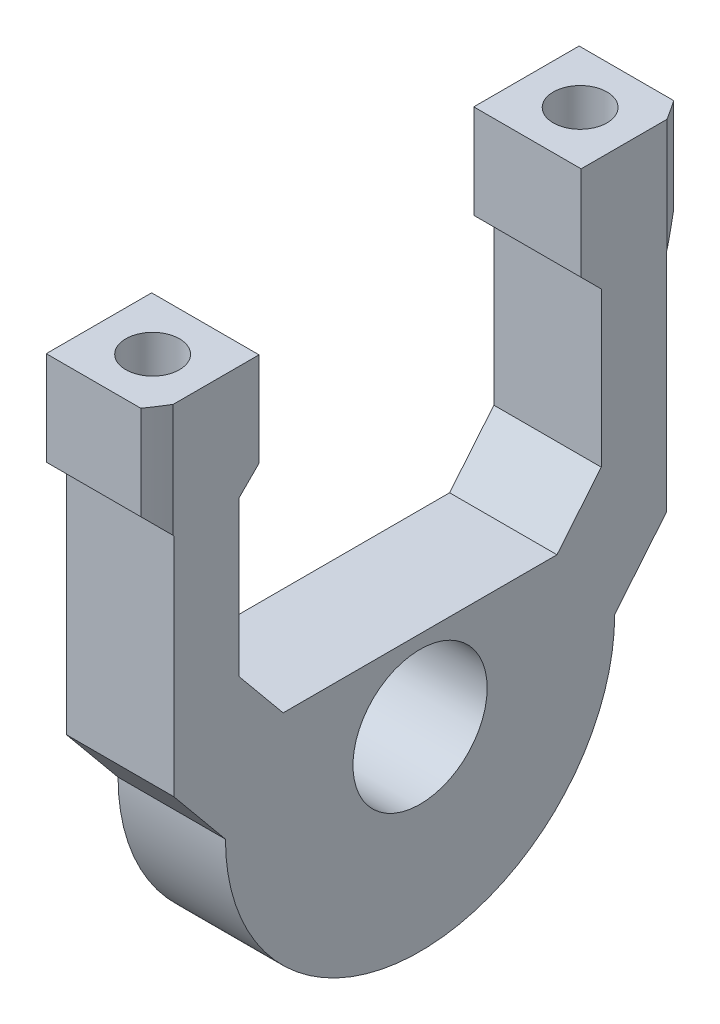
ISO-10303-21;
HEADER;
FILE_DESCRIPTION(('STEP AP214'),'2;1');
FILE_NAME('part.step','',(''),(''),'','','');
FILE_SCHEMA(('AUTOMOTIVE_DESIGN { 1 0 10303 214 1 1 1 1 }'));
ENDSEC;
DATA;
#1=APPLICATION_CONTEXT('core data for automotive mechanical design processes');
#2=APPLICATION_PROTOCOL_DEFINITION('international standard','automotive_design',2000,#1);
#3=PRODUCT_CONTEXT('',#1,'mechanical');
#4=PRODUCT('Part','Part','',(#3));
#5=PRODUCT_RELATED_PRODUCT_CATEGORY('part','',(#4));
#6=PRODUCT_DEFINITION_FORMATION('','',#4);
#7=PRODUCT_DEFINITION_CONTEXT('part definition',#1,'design');
#8=PRODUCT_DEFINITION('design','',#6,#7);
#9=PRODUCT_DEFINITION_SHAPE('','',#8);
#10=(LENGTH_UNIT() NAMED_UNIT(*) SI_UNIT(.MILLI.,.METRE.));
#11=(NAMED_UNIT(*) PLANE_ANGLE_UNIT() SI_UNIT($,.RADIAN.));
#12=(NAMED_UNIT(*) SI_UNIT($,.STERADIAN.) SOLID_ANGLE_UNIT());
#13=UNCERTAINTY_MEASURE_WITH_UNIT(LENGTH_MEASURE(1.E-05),#10,'distance_accuracy_value','');
#14=(GEOMETRIC_REPRESENTATION_CONTEXT(3) GLOBAL_UNCERTAINTY_ASSIGNED_CONTEXT((#13)) GLOBAL_UNIT_ASSIGNED_CONTEXT((#10,
#11,#12)) REPRESENTATION_CONTEXT('',''));
#15=CARTESIAN_POINT('',(0.,0.,0.));
#16=DIRECTION('',(0.,0.,1.));
#17=DIRECTION('',(1.,0.,0.));
#18=AXIS2_PLACEMENT_3D('',#15,#16,#17);
#19=CARTESIAN_POINT('',(-8.445,0.,18.35));
#20=DIRECTION('',(0.,0.,-1.));
#21=DIRECTION('',(-1.,0.,0.));
#22=AXIS2_PLACEMENT_3D('',#19,#20,#21);
#23=PLANE('',#22);
#24=DIRECTION('',(0.,1.,0.));
#25=VECTOR('',#24,1.);
#26=CARTESIAN_POINT('',(-0.445,0.,18.35));
#27=LINE('',#26,#25);
#28=CARTESIAN_POINT('',(-0.445,4.66666666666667,18.35));
#29=VERTEX_POINT('',#28);
#30=CARTESIAN_POINT('',(-0.445,21.5,18.35));
#31=VERTEX_POINT('',#30);
#32=EDGE_CURVE('E400',#29,#31,#27,.T.);
#33=ORIENTED_EDGE('',*,*,#32,.T.);
#34=DIRECTION('',(1.,0.,0.));
#35=VECTOR('',#34,1.);
#36=CARTESIAN_POINT('',(-18.0626920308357,21.5,18.35));
#37=LINE('',#36,#35);
#38=CARTESIAN_POINT('',(-8.445,21.5,18.35));
#39=VERTEX_POINT('',#38);
#40=EDGE_CURVE('E333',#39,#31,#37,.T.);
#41=ORIENTED_EDGE('',*,*,#40,.F.);
#42=DIRECTION('',(0.,1.,0.));
#43=VECTOR('',#42,1.);
#44=CARTESIAN_POINT('',(-8.445,0.,18.35));
#45=LINE('',#44,#43);
#46=CARTESIAN_POINT('',(-8.445,4.66666666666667,18.35));
#47=VERTEX_POINT('',#46);
#48=EDGE_CURVE('E362',#47,#39,#45,.T.);
#49=ORIENTED_EDGE('',*,*,#48,.F.);
#50=DIRECTION('',(1.,0.,0.));
#51=VECTOR('',#50,1.);
#52=CARTESIAN_POINT('',(-8.445,4.66666666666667,18.35));
#53=LINE('',#52,#51);
#54=EDGE_CURVE('E438',#47,#29,#53,.T.);
#55=ORIENTED_EDGE('',*,*,#54,.T.);
#56=EDGE_LOOP('',(#33,#41,#49,#55));
#57=FACE_BOUND('',#56,.T.);
#58=ADVANCED_FACE('F56',(#57),#23,.F.);
#59=CARTESIAN_POINT('',(-8.445,-7.1178876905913,8.62774265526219));
#60=DIRECTION('',(0.,-0.636382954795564,0.771373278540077));
#61=DIRECTION('',(0.,-0.771373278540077,-0.636382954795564));
#62=AXIS2_PLACEMENT_3D('',#59,#60,#61);
#63=PLANE('',#62);
#64=DIRECTION('',(0.,-0.771373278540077,-0.636382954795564));
#65=VECTOR('',#64,1.);
#66=CARTESIAN_POINT('',(-0.445,-7.1178876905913,8.62774265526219));
#67=LINE('',#66,#65);
#68=CARTESIAN_POINT('',(-0.445,0.,14.5));
#69=VERTEX_POINT('',#68);
#70=EDGE_CURVE('E404',#29,#69,#67,.T.);
#71=ORIENTED_EDGE('',*,*,#70,.F.);
#72=ORIENTED_EDGE('',*,*,#54,.F.);
#73=DIRECTION('',(0.,-0.771373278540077,-0.636382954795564));
#74=VECTOR('',#73,1.);
#75=CARTESIAN_POINT('',(-8.445,-7.1178876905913,8.62774265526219));
#76=LINE('',#75,#74);
#77=CARTESIAN_POINT('',(-8.445,0.,14.5));
#78=VERTEX_POINT('',#77);
#79=EDGE_CURVE('E366',#47,#78,#76,.T.);
#80=ORIENTED_EDGE('',*,*,#79,.T.);
#81=DIRECTION('',(1.,0.,0.));
#82=VECTOR('',#81,1.);
#83=CARTESIAN_POINT('',(-8.445,0.,14.5));
#84=LINE('',#83,#82);
#85=EDGE_CURVE('E435',#78,#69,#84,.T.);
#86=ORIENTED_EDGE('',*,*,#85,.T.);
#87=EDGE_LOOP('',(#71,#72,#80,#86));
#88=FACE_BOUND('',#87,.T.);
#89=ADVANCED_FACE('F476',(#88),#63,.T.);
#90=CARTESIAN_POINT('',(-8.445,0.,0.));
#91=DIRECTION('',(1.,0.,0.));
#92=DIRECTION('',(0.,0.,-1.));
#93=AXIS2_PLACEMENT_3D('',#90,#91,#92);
#94=CYLINDRICAL_SURFACE('',#93,14.5);
#95=CARTESIAN_POINT('',(-0.445,0.,0.));
#96=DIRECTION('',(1.,0.,0.));
#97=DIRECTION('',(0.,0.,-1.));
#98=AXIS2_PLACEMENT_3D('',#95,#96,#97);
#99=CIRCLE('',#98,14.5);
#100=CARTESIAN_POINT('',(-0.445,0.,-14.5));
#101=VERTEX_POINT('',#100);
#102=EDGE_CURVE('E408',#69,#101,#99,.T.);
#103=ORIENTED_EDGE('',*,*,#102,.F.);
#104=ORIENTED_EDGE('',*,*,#85,.F.);
#105=CARTESIAN_POINT('',(-8.445,0.,0.));
#106=DIRECTION('',(1.,0.,0.));
#107=DIRECTION('',(0.,0.,-1.));
#108=AXIS2_PLACEMENT_3D('',#105,#106,#107);
#109=CIRCLE('',#108,14.5);
#110=CARTESIAN_POINT('',(-8.445,0.,-14.5));
#111=VERTEX_POINT('',#110);
#112=EDGE_CURVE('E370',#78,#111,#109,.T.);
#113=ORIENTED_EDGE('',*,*,#112,.T.);
#114=DIRECTION('',(1.,0.,0.));
#115=VECTOR('',#114,1.);
#116=CARTESIAN_POINT('',(-8.445,0.,-14.5));
#117=LINE('',#116,#115);
#118=EDGE_CURVE('E432',#111,#101,#117,.T.);
#119=ORIENTED_EDGE('',*,*,#118,.T.);
#120=EDGE_LOOP('',(#103,#104,#113,#119));
#121=FACE_BOUND('',#120,.T.);
#122=ADVANCED_FACE('F482',(#121),#94,.T.);
#123=CARTESIAN_POINT('',(-8.445,-7.1178876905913,-8.62774265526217));
#124=DIRECTION('',(0.,0.636382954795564,0.771373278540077));
#125=DIRECTION('',(0.,-0.771373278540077,0.636382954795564));
#126=AXIS2_PLACEMENT_3D('',#123,#124,#125);
#127=PLANE('',#126);
#128=DIRECTION('',(0.,-0.771373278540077,0.636382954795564));
#129=VECTOR('',#128,1.);
#130=CARTESIAN_POINT('',(-0.445,-7.1178876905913,-8.62774265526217));
#131=LINE('',#130,#129);
#132=CARTESIAN_POINT('',(-0.445,4.66666666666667,-18.35));
#133=VERTEX_POINT('',#132);
#134=EDGE_CURVE('E412',#133,#101,#131,.T.);
#135=ORIENTED_EDGE('',*,*,#134,.T.);
#136=ORIENTED_EDGE('',*,*,#118,.F.);
#137=DIRECTION('',(0.,-0.771373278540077,0.636382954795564));
#138=VECTOR('',#137,1.);
#139=CARTESIAN_POINT('',(-8.445,-7.1178876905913,-8.62774265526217));
#140=LINE('',#139,#138);
#141=CARTESIAN_POINT('',(-8.445,4.66666666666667,-18.35));
#142=VERTEX_POINT('',#141);
#143=EDGE_CURVE('E374',#142,#111,#140,.T.);
#144=ORIENTED_EDGE('',*,*,#143,.F.);
#145=DIRECTION('',(1.,0.,0.));
#146=VECTOR('',#145,1.);
#147=CARTESIAN_POINT('',(-8.445,4.66666666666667,-18.35));
#148=LINE('',#147,#146);
#149=EDGE_CURVE('E428',#142,#133,#148,.T.);
#150=ORIENTED_EDGE('',*,*,#149,.T.);
#151=EDGE_LOOP('',(#135,#136,#144,#150));
#152=FACE_BOUND('',#151,.T.);
#153=ADVANCED_FACE('F488',(#152),#127,.F.);
#154=CARTESIAN_POINT('',(-8.445,0.,-18.35));
#155=DIRECTION('',(0.,0.,1.));
#156=DIRECTION('',(0.,-1.,0.));
#157=AXIS2_PLACEMENT_3D('',#154,#155,#156);
#158=PLANE('',#157);
#159=DIRECTION('',(1.,0.,0.));
#160=VECTOR('',#159,1.);
#161=CARTESIAN_POINT('',(-18.0626920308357,21.5,-18.35));
#162=LINE('',#161,#160);
#163=CARTESIAN_POINT('',(-8.445,21.5,-18.35));
#164=VERTEX_POINT('',#163);
#165=CARTESIAN_POINT('',(-0.445,21.5,-18.35));
#166=VERTEX_POINT('',#165);
#167=EDGE_CURVE('E284',#164,#166,#162,.T.);
#168=ORIENTED_EDGE('',*,*,#167,.T.);
#169=DIRECTION('',(0.,-1.,0.));
#170=VECTOR('',#169,1.);
#171=CARTESIAN_POINT('',(-0.445,0.,-18.35));
#172=LINE('',#171,#170);
#173=EDGE_CURVE('E416',#166,#133,#172,.T.);
#174=ORIENTED_EDGE('',*,*,#173,.T.);
#175=ORIENTED_EDGE('',*,*,#149,.F.);
#176=DIRECTION('',(0.,-1.,0.));
#177=VECTOR('',#176,1.);
#178=CARTESIAN_POINT('',(-8.445,0.,-18.35));
#179=LINE('',#178,#177);
#180=EDGE_CURVE('E377',#164,#142,#179,.T.);
#181=ORIENTED_EDGE('',*,*,#180,.F.);
#182=EDGE_LOOP('',(#168,#174,#175,#181));
#183=FACE_BOUND('',#182,.T.);
#184=ADVANCED_FACE('F492',(#183),#158,.F.);
#185=CARTESIAN_POINT('',(-8.445,0.,-13.5));
#186=DIRECTION('',(0.,0.,1.));
#187=DIRECTION('',(1.,0.,0.));
#188=AXIS2_PLACEMENT_3D('',#185,#186,#187);
#189=PLANE('',#188);
#190=DIRECTION('',(1.,0.,0.));
#191=VECTOR('',#190,1.);
#192=CARTESIAN_POINT('',(-18.0626920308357,21.5,-13.5));
#193=LINE('',#192,#191);
#194=CARTESIAN_POINT('',(-8.445,21.5,-13.5));
#195=VERTEX_POINT('',#194);
#196=CARTESIAN_POINT('',(-0.445,21.5,-13.5));
#197=VERTEX_POINT('',#196);
#198=EDGE_CURVE('E294',#195,#197,#193,.T.);
#199=ORIENTED_EDGE('',*,*,#198,.F.);
#200=DIRECTION('',(0.,-1.,0.));
#201=VECTOR('',#200,1.);
#202=CARTESIAN_POINT('',(-8.445,0.,-13.5));
#203=LINE('',#202,#201);
#204=CARTESIAN_POINT('',(-8.445,10.,-13.5));
#205=VERTEX_POINT('',#204);
#206=EDGE_CURVE('E380',#195,#205,#203,.T.);
#207=ORIENTED_EDGE('',*,*,#206,.T.);
#208=DIRECTION('',(1.,0.,0.));
#209=VECTOR('',#208,1.);
#210=CARTESIAN_POINT('',(-8.445,10.,-13.5));
#211=LINE('',#210,#209);
#212=CARTESIAN_POINT('',(-0.445,10.,-13.5));
#213=VERTEX_POINT('',#212);
#214=EDGE_CURVE('E66',#205,#213,#211,.T.);
#215=ORIENTED_EDGE('',*,*,#214,.T.);
#216=DIRECTION('',(0.,-1.,0.));
#217=VECTOR('',#216,1.);
#218=CARTESIAN_POINT('',(-0.445,0.,-13.5));
#219=LINE('',#218,#217);
#220=EDGE_CURVE('E419',#197,#213,#219,.T.);
#221=ORIENTED_EDGE('',*,*,#220,.F.);
#222=EDGE_LOOP('',(#199,#207,#215,#221));
#223=FACE_BOUND('',#222,.T.);
#224=ADVANCED_FACE('F496',(#223),#189,.T.);
#225=CARTESIAN_POINT('',(-8.445,-2.5771662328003,-3.12383785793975));
#226=DIRECTION('',(0.,-0.636382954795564,-0.771373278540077));
#227=DIRECTION('',(0.,0.771373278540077,-0.636382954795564));
#228=AXIS2_PLACEMENT_3D('',#225,#226,#227);
#229=PLANE('',#228);
#230=DIRECTION('',(0.,0.771373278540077,-0.636382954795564));
#231=VECTOR('',#230,1.);
#232=CARTESIAN_POINT('',(-0.445,-2.5771662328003,-3.12383785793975));
#233=LINE('',#232,#231);
#234=CARTESIAN_POINT('',(-0.445,6.,-10.2));
#235=VERTEX_POINT('',#234);
#236=EDGE_CURVE('E352',#235,#213,#233,.T.);
#237=ORIENTED_EDGE('',*,*,#236,.T.);
#238=ORIENTED_EDGE('',*,*,#214,.F.);
#239=DIRECTION('',(0.,0.771373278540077,-0.636382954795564));
#240=VECTOR('',#239,1.);
#241=CARTESIAN_POINT('',(-8.445,-2.5771662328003,-3.12383785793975));
#242=LINE('',#241,#240);
#243=CARTESIAN_POINT('',(-8.445,6.,-10.2));
#244=VERTEX_POINT('',#243);
#245=EDGE_CURVE('E383',#244,#205,#242,.T.);
#246=ORIENTED_EDGE('',*,*,#245,.F.);
#247=DIRECTION('',(1.,0.,0.));
#248=VECTOR('',#247,1.);
#249=CARTESIAN_POINT('',(-8.445,6.,-10.2));
#250=LINE('',#249,#248);
#251=EDGE_CURVE('E14',#244,#235,#250,.T.);
#252=ORIENTED_EDGE('',*,*,#251,.T.);
#253=EDGE_LOOP('',(#237,#238,#246,#252));
#254=FACE_BOUND('',#253,.T.);
#255=ADVANCED_FACE('F458',(#254),#229,.F.);
#256=CARTESIAN_POINT('',(-8.445,6.,0.));
#257=DIRECTION('',(0.,-1.,0.));
#258=DIRECTION('',(0.,0.,-1.));
#259=AXIS2_PLACEMENT_3D('',#256,#257,#258);
#260=PLANE('',#259);
#261=DIRECTION('',(0.,0.,-1.));
#262=VECTOR('',#261,1.);
#263=CARTESIAN_POINT('',(-0.445,6.,0.));
#264=LINE('',#263,#262);
#265=CARTESIAN_POINT('',(-0.445,6.,10.2));
#266=VERTEX_POINT('',#265);
#267=EDGE_CURVE('E390',#266,#235,#264,.T.);
#268=ORIENTED_EDGE('',*,*,#267,.T.);
#269=ORIENTED_EDGE('',*,*,#251,.F.);
#270=DIRECTION('',(0.,0.,-1.));
#271=VECTOR('',#270,1.);
#272=CARTESIAN_POINT('',(-8.445,6.,0.));
#273=LINE('',#272,#271);
#274=CARTESIAN_POINT('',(-8.445,6.,10.2));
#275=VERTEX_POINT('',#274);
#276=EDGE_CURVE('E351',#275,#244,#273,.T.);
#277=ORIENTED_EDGE('',*,*,#276,.F.);
#278=DIRECTION('',(1.,0.,0.));
#279=VECTOR('',#278,1.);
#280=CARTESIAN_POINT('',(-8.445,6.,10.2));
#281=LINE('',#280,#279);
#282=EDGE_CURVE('E60',#275,#266,#281,.T.);
#283=ORIENTED_EDGE('',*,*,#282,.T.);
#284=EDGE_LOOP('',(#268,#269,#277,#283));
#285=FACE_BOUND('',#284,.T.);
#286=ADVANCED_FACE('F453',(#285),#260,.F.);
#287=CARTESIAN_POINT('',(-8.445,-2.5771662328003,3.12383785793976));
#288=DIRECTION('',(0.,-0.636382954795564,0.771373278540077));
#289=DIRECTION('',(0.,-0.771373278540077,-0.636382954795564));
#290=AXIS2_PLACEMENT_3D('',#287,#288,#289);
#291=PLANE('',#290);
#292=DIRECTION('',(0.,-0.771373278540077,-0.636382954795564));
#293=VECTOR('',#292,1.);
#294=CARTESIAN_POINT('',(-0.445,-2.5771662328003,3.12383785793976));
#295=LINE('',#294,#293);
#296=CARTESIAN_POINT('',(-0.445,10.,13.5));
#297=VERTEX_POINT('',#296);
#298=EDGE_CURVE('E394',#297,#266,#295,.T.);
#299=ORIENTED_EDGE('',*,*,#298,.T.);
#300=ORIENTED_EDGE('',*,*,#282,.F.);
#301=DIRECTION('',(0.,-0.771373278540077,-0.636382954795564));
#302=VECTOR('',#301,1.);
#303=CARTESIAN_POINT('',(-8.445,-2.5771662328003,3.12383785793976));
#304=LINE('',#303,#302);
#305=CARTESIAN_POINT('',(-8.445,10.,13.5));
#306=VERTEX_POINT('',#305);
#307=EDGE_CURVE('E356',#306,#275,#304,.T.);
#308=ORIENTED_EDGE('',*,*,#307,.F.);
#309=DIRECTION('',(1.,0.,0.));
#310=VECTOR('',#309,1.);
#311=CARTESIAN_POINT('',(-8.445,10.,13.5));
#312=LINE('',#311,#310);
#313=EDGE_CURVE('E440',#306,#297,#312,.T.);
#314=ORIENTED_EDGE('',*,*,#313,.T.);
#315=EDGE_LOOP('',(#299,#300,#308,#314));
#316=FACE_BOUND('',#315,.T.);
#317=ADVANCED_FACE('F463',(#316),#291,.F.);
#318=CARTESIAN_POINT('',(-8.445,0.,13.5));
#319=DIRECTION('',(0.,0.,1.));
#320=DIRECTION('',(0.,-1.,0.));
#321=AXIS2_PLACEMENT_3D('',#318,#319,#320);
#322=PLANE('',#321);
#323=DIRECTION('',(1.,0.,0.));
#324=VECTOR('',#323,1.);
#325=CARTESIAN_POINT('',(-18.0626920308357,21.5,13.5));
#326=LINE('',#325,#324);
#327=CARTESIAN_POINT('',(-8.445,21.5,13.5));
#328=VERTEX_POINT('',#327);
#329=CARTESIAN_POINT('',(-0.445,21.5,13.5));
#330=VERTEX_POINT('',#329);
#331=EDGE_CURVE('E322',#328,#330,#326,.T.);
#332=ORIENTED_EDGE('',*,*,#331,.T.);
#333=DIRECTION('',(0.,-1.,0.));
#334=VECTOR('',#333,1.);
#335=CARTESIAN_POINT('',(-0.445,0.,13.5));
#336=LINE('',#335,#334);
#337=EDGE_CURVE('E397',#330,#297,#336,.T.);
#338=ORIENTED_EDGE('',*,*,#337,.T.);
#339=ORIENTED_EDGE('',*,*,#313,.F.);
#340=DIRECTION('',(0.,-1.,0.));
#341=VECTOR('',#340,1.);
#342=CARTESIAN_POINT('',(-8.445,0.,13.5));
#343=LINE('',#342,#341);
#344=EDGE_CURVE('E359',#328,#306,#343,.T.);
#345=ORIENTED_EDGE('',*,*,#344,.F.);
#346=EDGE_LOOP('',(#332,#338,#339,#345));
#347=FACE_BOUND('',#346,.T.);
#348=ADVANCED_FACE('F465',(#347),#322,.F.);
#349=CARTESIAN_POINT('',(-8.445,0.,0.));
#350=DIRECTION('',(1.,0.,0.));
#351=DIRECTION('',(0.,0.,-1.));
#352=AXIS2_PLACEMENT_3D('',#349,#350,#351);
#353=CYLINDRICAL_SURFACE('',#352,5.);
#354=CARTESIAN_POINT('',(-8.445,0.,0.));
#355=DIRECTION('',(1.,0.,0.));
#356=DIRECTION('',(0.,0.,-1.));
#357=AXIS2_PLACEMENT_3D('',#354,#355,#356);
#358=CIRCLE('',#357,5.);
#359=CARTESIAN_POINT('',(-8.445,0.,-5.));
#360=VERTEX_POINT('',#359);
#361=EDGE_CURVE('E347',#360,#360,#358,.T.);
#362=ORIENTED_EDGE('',*,*,#361,.F.);
#363=EDGE_LOOP('',(#362));
#364=FACE_BOUND('',#363,.T.);
#365=CARTESIAN_POINT('',(-0.445,0.,0.));
#366=DIRECTION('',(1.,0.,0.));
#367=DIRECTION('',(0.,0.,-1.));
#368=AXIS2_PLACEMENT_3D('',#365,#366,#367);
#369=CIRCLE('',#368,5.);
#370=CARTESIAN_POINT('',(-0.445,0.,-5.));
#371=VERTEX_POINT('',#370);
#372=EDGE_CURVE('E346',#371,#371,#369,.T.);
#373=ORIENTED_EDGE('',*,*,#372,.T.);
#374=EDGE_LOOP('',(#373));
#375=FACE_BOUND('',#374,.T.);
#376=ADVANCED_FACE('F58',(#364,#375),#353,.F.);
#377=CARTESIAN_POINT('',(-18.0626920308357,1.57500000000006,1.57500000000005));
#378=DIRECTION('',(0.,0.707106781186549,0.707106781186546));
#379=DIRECTION('',(0.,-0.707106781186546,0.707106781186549));
#380=AXIS2_PLACEMENT_3D('',#377,#378,#379);
#381=PLANE('',#380);
#382=CARTESIAN_POINT('',(-30.2225,3.1500000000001,0.));
#383=DIRECTION('',(0.,0.707106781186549,0.707106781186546));
#384=DIRECTION('',(0.,0.707106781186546,-0.707106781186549));
#385=AXIS2_PLACEMENT_3D('',#382,#383,#384);
#386=ELLIPSE('',#385,49.4974746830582,35.);
#387=CARTESIAN_POINT('',(-0.445,21.5429468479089,-18.3929468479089));
#388=VERTEX_POINT('',#387);
#389=CARTESIAN_POINT('',(-1.39581965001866,23.,-19.85));
#390=VERTEX_POINT('',#389);
#391=EDGE_CURVE('E257',#388,#390,#386,.T.);
#392=ORIENTED_EDGE('',*,*,#391,.F.);
#393=DIRECTION('',(0.,-0.707106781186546,0.707106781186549));
#394=VECTOR('',#393,1.);
#395=CARTESIAN_POINT('',(-0.445,1.57500000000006,1.57500000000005));
#396=LINE('',#395,#394);
#397=EDGE_CURVE('E273',#388,#166,#396,.T.);
#398=ORIENTED_EDGE('',*,*,#397,.T.);
#399=ORIENTED_EDGE('',*,*,#167,.F.);
#400=DIRECTION('',(0.,0.707106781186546,-0.707106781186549));
#401=VECTOR('',#400,1.);
#402=CARTESIAN_POINT('',(-8.445,1.57500000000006,1.57500000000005));
#403=LINE('',#402,#401);
#404=CARTESIAN_POINT('',(-8.445,23.,-19.85));
#405=VERTEX_POINT('',#404);
#406=EDGE_CURVE('E274',#164,#405,#403,.T.);
#407=ORIENTED_EDGE('',*,*,#406,.T.);
#408=DIRECTION('',(1.,0.,0.));
#409=VECTOR('',#408,1.);
#410=CARTESIAN_POINT('',(-18.0626920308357,23.,-19.85));
#411=LINE('',#410,#409);
#412=EDGE_CURVE('E278',#405,#390,#411,.T.);
#413=ORIENTED_EDGE('',*,*,#412,.T.);
#414=EDGE_LOOP('',(#392,#398,#399,#407,#413));
#415=FACE_BOUND('',#414,.T.);
#416=ADVANCED_FACE('F523',(#415),#381,.F.);
#417=CARTESIAN_POINT('',(-18.0626920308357,1.57500000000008,-1.57500000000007));
#418=DIRECTION('',(0.,-0.70710678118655,0.707106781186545));
#419=DIRECTION('',(0.,-0.707106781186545,-0.70710678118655));
#420=AXIS2_PLACEMENT_3D('',#417,#418,#419);
#421=PLANE('',#420);
#422=DIRECTION('',(0.,-0.707106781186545,-0.70710678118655));
#423=VECTOR('',#422,1.);
#424=CARTESIAN_POINT('',(-0.445,1.57500000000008,-1.57500000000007));
#425=LINE('',#424,#423);
#426=CARTESIAN_POINT('',(-0.445,21.5429468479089,18.3929468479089));
#427=VERTEX_POINT('',#426);
#428=EDGE_CURVE('E315',#427,#31,#425,.T.);
#429=ORIENTED_EDGE('',*,*,#428,.F.);
#430=CARTESIAN_POINT('',(-30.2225,3.15000000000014,0.));
#431=DIRECTION('',(0.,-0.70710678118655,0.707106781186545));
#432=DIRECTION('',(0.,0.707106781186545,0.70710678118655));
#433=AXIS2_PLACEMENT_3D('',#430,#431,#432);
#434=ELLIPSE('',#433,49.4974746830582,35.);
#435=CARTESIAN_POINT('',(-1.39581965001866,23.,19.85));
#436=VERTEX_POINT('',#435);
#437=EDGE_CURVE('E266',#427,#436,#434,.T.);
#438=ORIENTED_EDGE('',*,*,#437,.T.);
#439=DIRECTION('',(1.,0.,0.));
#440=VECTOR('',#439,1.);
#441=CARTESIAN_POINT('',(-18.0626920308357,23.,19.85));
#442=LINE('',#441,#440);
#443=CARTESIAN_POINT('',(-8.445,23.,19.85));
#444=VERTEX_POINT('',#443);
#445=EDGE_CURVE('E336',#444,#436,#442,.T.);
#446=ORIENTED_EDGE('',*,*,#445,.F.);
#447=DIRECTION('',(0.,0.707106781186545,0.70710678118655));
#448=VECTOR('',#447,1.);
#449=CARTESIAN_POINT('',(-8.445,1.57500000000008,-1.57500000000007));
#450=LINE('',#449,#448);
#451=EDGE_CURVE('E329',#39,#444,#450,.T.);
#452=ORIENTED_EDGE('',*,*,#451,.F.);
#453=ORIENTED_EDGE('',*,*,#40,.T.);
#454=EDGE_LOOP('',(#429,#438,#446,#452,#453));
#455=FACE_BOUND('',#454,.T.);
#456=ADVANCED_FACE('F519',(#455),#421,.T.);
#457=CARTESIAN_POINT('',(-18.0626920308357,17.5000000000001,17.5));
#458=DIRECTION('',(0.,0.70710678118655,0.707106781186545));
#459=DIRECTION('',(0.,-0.707106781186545,0.70710678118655));
#460=AXIS2_PLACEMENT_3D('',#457,#458,#459);
#461=PLANE('',#460);
#462=ORIENTED_EDGE('',*,*,#331,.F.);
#463=DIRECTION('',(0.,0.707106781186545,-0.70710678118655));
#464=VECTOR('',#463,1.);
#465=CARTESIAN_POINT('',(-8.445,17.5000000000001,17.5));
#466=LINE('',#465,#464);
#467=CARTESIAN_POINT('',(-8.445,23.,12.));
#468=VERTEX_POINT('',#467);
#469=EDGE_CURVE('E306',#328,#468,#466,.T.);
#470=ORIENTED_EDGE('',*,*,#469,.T.);
#471=DIRECTION('',(1.,0.,0.));
#472=VECTOR('',#471,1.);
#473=CARTESIAN_POINT('',(-18.0626920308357,23.,12.));
#474=LINE('',#473,#472);
#475=CARTESIAN_POINT('',(-0.445,23.,12.));
#476=VERTEX_POINT('',#475);
#477=EDGE_CURVE('E311',#468,#476,#474,.T.);
#478=ORIENTED_EDGE('',*,*,#477,.T.);
#479=DIRECTION('',(0.,-0.707106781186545,0.70710678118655));
#480=VECTOR('',#479,1.);
#481=CARTESIAN_POINT('',(-0.445,17.5000000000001,17.5));
#482=LINE('',#481,#480);
#483=EDGE_CURVE('E305',#476,#330,#482,.T.);
#484=ORIENTED_EDGE('',*,*,#483,.T.);
#485=EDGE_LOOP('',(#462,#470,#478,#484));
#486=FACE_BOUND('',#485,.T.);
#487=ADVANCED_FACE('F522',(#486),#461,.F.);
#488=CARTESIAN_POINT('',(-18.0626920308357,17.5000000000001,-17.5));
#489=DIRECTION('',(0.,-0.707106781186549,0.707106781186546));
#490=DIRECTION('',(0.,-0.707106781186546,-0.707106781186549));
#491=AXIS2_PLACEMENT_3D('',#488,#489,#490);
#492=PLANE('',#491);
#493=DIRECTION('',(0.,0.707106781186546,0.707106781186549));
#494=VECTOR('',#493,1.);
#495=CARTESIAN_POINT('',(-8.445,17.5000000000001,-17.5));
#496=LINE('',#495,#494);
#497=CARTESIAN_POINT('',(-8.445,23.,-12.));
#498=VERTEX_POINT('',#497);
#499=EDGE_CURVE('E291',#195,#498,#496,.T.);
#500=ORIENTED_EDGE('',*,*,#499,.F.);
#501=ORIENTED_EDGE('',*,*,#198,.T.);
#502=DIRECTION('',(0.,-0.707106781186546,-0.707106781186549));
#503=VECTOR('',#502,1.);
#504=CARTESIAN_POINT('',(-0.445,17.5000000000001,-17.5));
#505=LINE('',#504,#503);
#506=CARTESIAN_POINT('',(-0.445,23.,-12.));
#507=VERTEX_POINT('',#506);
#508=EDGE_CURVE('E225',#507,#197,#505,.T.);
#509=ORIENTED_EDGE('',*,*,#508,.F.);
#510=DIRECTION('',(1.,0.,0.));
#511=VECTOR('',#510,1.);
#512=CARTESIAN_POINT('',(-18.0626920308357,23.,-12.));
#513=LINE('',#512,#511);
#514=EDGE_CURVE('E221',#498,#507,#513,.T.);
#515=ORIENTED_EDGE('',*,*,#514,.F.);
#516=EDGE_LOOP('',(#500,#501,#509,#515));
#517=FACE_BOUND('',#516,.T.);
#518=ADVANCED_FACE('F527',(#517),#492,.T.);
#519=CARTESIAN_POINT('',(-30.2225,35.,0.));
#520=DIRECTION('',(0.,-1.,0.));
#521=DIRECTION('',(0.,0.,-1.));
#522=AXIS2_PLACEMENT_3D('',#519,#520,#521);
#523=CYLINDRICAL_SURFACE('',#522,35.);
#524=DIRECTION('',(0.,1.,0.));
#525=VECTOR('',#524,1.);
#526=CARTESIAN_POINT('',(-0.445000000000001,-14.5,18.3929468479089));
#527=LINE('',#526,#525);
#528=CARTESIAN_POINT('',(-0.445000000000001,30.,18.3929468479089));
#529=VERTEX_POINT('',#528);
#530=EDGE_CURVE('E270',#529,#427,#527,.F.);
#531=ORIENTED_EDGE('',*,*,#530,.F.);
#532=CARTESIAN_POINT('',(-30.2225,30.,0.));
#533=DIRECTION('',(0.,-1.,0.));
#534=DIRECTION('',(0.,0.,-1.));
#535=AXIS2_PLACEMENT_3D('',#532,#533,#534);
#536=CIRCLE('',#535,35.);
#537=CARTESIAN_POINT('',(-1.39581965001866,30.,19.85));
#538=VERTEX_POINT('',#537);
#539=EDGE_CURVE('E571',#529,#538,#536,.T.);
#540=ORIENTED_EDGE('',*,*,#539,.T.);
#541=DIRECTION('',(0.,1.,0.));
#542=VECTOR('',#541,1.);
#543=CARTESIAN_POINT('',(-1.39581965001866,-14.5,19.85));
#544=LINE('',#543,#542);
#545=EDGE_CURVE('E262',#436,#538,#544,.T.);
#546=ORIENTED_EDGE('',*,*,#545,.F.);
#547=ORIENTED_EDGE('',*,*,#437,.F.);
#548=EDGE_LOOP('',(#531,#540,#546,#547));
#549=FACE_BOUND('',#548,.T.);
#550=ADVANCED_FACE('F514',(#549),#523,.T.);
#551=DIRECTION('',(0.,1.,0.));
#552=VECTOR('',#551,1.);
#553=CARTESIAN_POINT('',(-1.39581965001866,-14.5,-19.85));
#554=LINE('',#553,#552);
#555=CARTESIAN_POINT('',(-1.39581965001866,30.,-19.85));
#556=VERTEX_POINT('',#555);
#557=EDGE_CURVE('E253',#390,#556,#554,.T.);
#558=ORIENTED_EDGE('',*,*,#557,.T.);
#559=CARTESIAN_POINT('',(-0.445,30.,-18.3929468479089));
#560=VERTEX_POINT('',#559);
#561=EDGE_CURVE('E578',#556,#560,#536,.T.);
#562=ORIENTED_EDGE('',*,*,#561,.T.);
#563=DIRECTION('',(0.,1.,0.));
#564=VECTOR('',#563,1.);
#565=CARTESIAN_POINT('',(-0.445000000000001,-14.5,-18.3929468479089));
#566=LINE('',#565,#564);
#567=EDGE_CURVE('E232',#388,#560,#566,.T.);
#568=ORIENTED_EDGE('',*,*,#567,.F.);
#569=ORIENTED_EDGE('',*,*,#391,.T.);
#570=EDGE_LOOP('',(#558,#562,#568,#569));
#571=FACE_BOUND('',#570,.T.);
#572=ADVANCED_FACE('F511',(#571),#523,.T.);
#573=CARTESIAN_POINT('',(-18.0626920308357,0.,-12.));
#574=DIRECTION('',(0.,0.,1.));
#575=DIRECTION('',(0.,-1.,0.));
#576=AXIS2_PLACEMENT_3D('',#573,#574,#575);
#577=PLANE('',#576);
#578=DIRECTION('',(1.,0.,0.));
#579=VECTOR('',#578,1.);
#580=CARTESIAN_POINT('',(-8.445,30.,-12.));
#581=LINE('',#580,#579);
#582=CARTESIAN_POINT('',(-8.445,30.,-12.));
#583=VERTEX_POINT('',#582);
#584=CARTESIAN_POINT('',(-0.445000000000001,30.,-12.));
#585=VERTEX_POINT('',#584);
#586=EDGE_CURVE('E205',#583,#585,#581,.T.);
#587=ORIENTED_EDGE('',*,*,#586,.F.);
#588=DIRECTION('',(0.,1.,0.));
#589=VECTOR('',#588,1.);
#590=CARTESIAN_POINT('',(-8.445,0.,-12.));
#591=LINE('',#590,#589);
#592=EDGE_CURVE('E293',#498,#583,#591,.T.);
#593=ORIENTED_EDGE('',*,*,#592,.F.);
#594=ORIENTED_EDGE('',*,*,#514,.T.);
#595=DIRECTION('',(0.,-1.,0.));
#596=VECTOR('',#595,1.);
#597=CARTESIAN_POINT('',(-0.445,0.,-12.));
#598=LINE('',#597,#596);
#599=EDGE_CURVE('E218',#585,#507,#598,.T.);
#600=ORIENTED_EDGE('',*,*,#599,.F.);
#601=EDGE_LOOP('',(#587,#593,#594,#600));
#602=FACE_BOUND('',#601,.T.);
#603=ADVANCED_FACE('F219',(#602),#577,.T.);
#604=CARTESIAN_POINT('',(-18.0626920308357,0.,12.));
#605=DIRECTION('',(0.,0.,1.));
#606=DIRECTION('',(0.,-1.,0.));
#607=AXIS2_PLACEMENT_3D('',#604,#605,#606);
#608=PLANE('',#607);
#609=DIRECTION('',(0.,1.,0.));
#610=VECTOR('',#609,1.);
#611=CARTESIAN_POINT('',(-8.445,0.,12.));
#612=LINE('',#611,#610);
#613=CARTESIAN_POINT('',(-8.445,30.,12.));
#614=VERTEX_POINT('',#613);
#615=EDGE_CURVE('E310',#468,#614,#612,.T.);
#616=ORIENTED_EDGE('',*,*,#615,.T.);
#617=DIRECTION('',(-1.,0.,0.));
#618=VECTOR('',#617,1.);
#619=CARTESIAN_POINT('',(-0.445000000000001,30.,12.));
#620=LINE('',#619,#618);
#621=CARTESIAN_POINT('',(-0.445,30.,12.));
#622=VERTEX_POINT('',#621);
#623=EDGE_CURVE('E236',#622,#614,#620,.T.);
#624=ORIENTED_EDGE('',*,*,#623,.F.);
#625=DIRECTION('',(0.,-1.,0.));
#626=VECTOR('',#625,1.);
#627=CARTESIAN_POINT('',(-0.445,0.,12.));
#628=LINE('',#627,#626);
#629=EDGE_CURVE('E319',#622,#476,#628,.T.);
#630=ORIENTED_EDGE('',*,*,#629,.T.);
#631=ORIENTED_EDGE('',*,*,#477,.F.);
#632=EDGE_LOOP('',(#616,#624,#630,#631));
#633=FACE_BOUND('',#632,.T.);
#634=ADVANCED_FACE('F509',(#633),#608,.F.);
#635=CARTESIAN_POINT('',(-8.445,0.,0.));
#636=DIRECTION('',(1.,0.,0.));
#637=DIRECTION('',(0.,0.,-1.));
#638=AXIS2_PLACEMENT_3D('',#635,#636,#637);
#639=PLANE('',#638);
#640=ORIENTED_EDGE('',*,*,#361,.T.);
#641=EDGE_LOOP('',(#640));
#642=FACE_BOUND('',#641,.T.);
#643=DIRECTION('',(0.,1.,0.));
#644=VECTOR('',#643,1.);
#645=CARTESIAN_POINT('',(-8.445,0.,19.85));
#646=LINE('',#645,#644);
#647=CARTESIAN_POINT('',(-8.445,30.,19.85));
#648=VERTEX_POINT('',#647);
#649=EDGE_CURVE('E332',#444,#648,#646,.T.);
#650=ORIENTED_EDGE('',*,*,#649,.T.);
#651=DIRECTION('',(0.,0.,1.));
#652=VECTOR('',#651,1.);
#653=CARTESIAN_POINT('',(-8.445,30.,12.));
#654=LINE('',#653,#652);
#655=EDGE_CURVE('E242',#614,#648,#654,.T.);
#656=ORIENTED_EDGE('',*,*,#655,.F.);
#657=ORIENTED_EDGE('',*,*,#615,.F.);
#658=ORIENTED_EDGE('',*,*,#469,.F.);
#659=ORIENTED_EDGE('',*,*,#344,.T.);
#660=ORIENTED_EDGE('',*,*,#307,.T.);
#661=ORIENTED_EDGE('',*,*,#276,.T.);
#662=ORIENTED_EDGE('',*,*,#245,.T.);
#663=ORIENTED_EDGE('',*,*,#206,.F.);
#664=ORIENTED_EDGE('',*,*,#499,.T.);
#665=ORIENTED_EDGE('',*,*,#592,.T.);
#666=DIRECTION('',(0.,0.,1.));
#667=VECTOR('',#666,1.);
#668=CARTESIAN_POINT('',(-8.445,30.,-19.85));
#669=LINE('',#668,#667);
#670=CARTESIAN_POINT('',(-8.445,30.,-19.85));
#671=VERTEX_POINT('',#670);
#672=EDGE_CURVE('E82',#671,#583,#669,.T.);
#673=ORIENTED_EDGE('',*,*,#672,.F.);
#674=DIRECTION('',(0.,1.,0.));
#675=VECTOR('',#674,1.);
#676=CARTESIAN_POINT('',(-8.445,0.,-19.85));
#677=LINE('',#676,#675);
#678=EDGE_CURVE('E226',#405,#671,#677,.T.);
#679=ORIENTED_EDGE('',*,*,#678,.F.);
#680=ORIENTED_EDGE('',*,*,#406,.F.);
#681=ORIENTED_EDGE('',*,*,#180,.T.);
#682=ORIENTED_EDGE('',*,*,#143,.T.);
#683=ORIENTED_EDGE('',*,*,#112,.F.);
#684=ORIENTED_EDGE('',*,*,#79,.F.);
#685=ORIENTED_EDGE('',*,*,#48,.T.);
#686=ORIENTED_EDGE('',*,*,#451,.T.);
#687=EDGE_LOOP('',(#650,#656,#657,#658,#659,#660,#661,#662,#663,#664,#665,#673,#679,#680,#681,
#682,#683,#684,#685,#686));
#688=FACE_BOUND('',#687,.T.);
#689=ADVANCED_FACE('F461',(#642,#688),#639,.F.);
#690=CARTESIAN_POINT('',(-18.0626920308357,0.,-19.85));
#691=DIRECTION('',(0.,0.,1.));
#692=DIRECTION('',(1.,0.,0.));
#693=AXIS2_PLACEMENT_3D('',#690,#691,#692);
#694=PLANE('',#693);
#695=ORIENTED_EDGE('',*,*,#678,.T.);
#696=DIRECTION('',(-1.,0.,0.));
#697=VECTOR('',#696,1.);
#698=CARTESIAN_POINT('',(-1.39581965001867,30.,-19.85));
#699=LINE('',#698,#697);
#700=EDGE_CURVE('E248',#556,#671,#699,.T.);
#701=ORIENTED_EDGE('',*,*,#700,.F.);
#702=ORIENTED_EDGE('',*,*,#557,.F.);
#703=ORIENTED_EDGE('',*,*,#412,.F.);
#704=EDGE_LOOP('',(#695,#701,#702,#703));
#705=FACE_BOUND('',#704,.T.);
#706=ADVANCED_FACE('F508',(#705),#694,.F.);
#707=CARTESIAN_POINT('',(-18.0626920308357,0.,19.85));
#708=DIRECTION('',(0.,0.,1.));
#709=DIRECTION('',(1.,0.,0.));
#710=AXIS2_PLACEMENT_3D('',#707,#708,#709);
#711=PLANE('',#710);
#712=DIRECTION('',(1.,0.,0.));
#713=VECTOR('',#712,1.);
#714=CARTESIAN_POINT('',(-8.445,30.,19.85));
#715=LINE('',#714,#713);
#716=EDGE_CURVE('E245',#648,#538,#715,.T.);
#717=ORIENTED_EDGE('',*,*,#716,.F.);
#718=ORIENTED_EDGE('',*,*,#649,.F.);
#719=ORIENTED_EDGE('',*,*,#445,.T.);
#720=ORIENTED_EDGE('',*,*,#545,.T.);
#721=EDGE_LOOP('',(#717,#718,#719,#720));
#722=FACE_BOUND('',#721,.T.);
#723=ADVANCED_FACE('F505',(#722),#711,.T.);
#724=CARTESIAN_POINT('',(-0.445,0.,0.));
#725=DIRECTION('',(1.,0.,0.));
#726=DIRECTION('',(0.,0.,-1.));
#727=AXIS2_PLACEMENT_3D('',#724,#725,#726);
#728=PLANE('',#727);
#729=DIRECTION('',(0.,0.,-1.));
#730=VECTOR('',#729,1.);
#731=CARTESIAN_POINT('',(-0.445000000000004,30.,18.3929468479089));
#732=LINE('',#731,#730);
#733=EDGE_CURVE('E74',#529,#622,#732,.T.);
#734=ORIENTED_EDGE('',*,*,#733,.F.);
#735=ORIENTED_EDGE('',*,*,#530,.T.);
#736=ORIENTED_EDGE('',*,*,#428,.T.);
#737=ORIENTED_EDGE('',*,*,#32,.F.);
#738=ORIENTED_EDGE('',*,*,#70,.T.);
#739=ORIENTED_EDGE('',*,*,#102,.T.);
#740=ORIENTED_EDGE('',*,*,#134,.F.);
#741=ORIENTED_EDGE('',*,*,#173,.F.);
#742=ORIENTED_EDGE('',*,*,#397,.F.);
#743=ORIENTED_EDGE('',*,*,#567,.T.);
#744=DIRECTION('',(0.,0.,-1.));
#745=VECTOR('',#744,1.);
#746=CARTESIAN_POINT('',(-0.445,30.,-12.));
#747=LINE('',#746,#745);
#748=EDGE_CURVE('E209',#585,#560,#747,.T.);
#749=ORIENTED_EDGE('',*,*,#748,.F.);
#750=ORIENTED_EDGE('',*,*,#599,.T.);
#751=ORIENTED_EDGE('',*,*,#508,.T.);
#752=ORIENTED_EDGE('',*,*,#220,.T.);
#753=ORIENTED_EDGE('',*,*,#236,.F.);
#754=ORIENTED_EDGE('',*,*,#267,.F.);
#755=ORIENTED_EDGE('',*,*,#298,.F.);
#756=ORIENTED_EDGE('',*,*,#337,.F.);
#757=ORIENTED_EDGE('',*,*,#483,.F.);
#758=ORIENTED_EDGE('',*,*,#629,.F.);
#759=EDGE_LOOP('',(#734,#735,#736,#737,#738,#739,#740,#741,#742,#743,#749,#750,#751,#752,#753,
#754,#755,#756,#757,#758));
#760=FACE_BOUND('',#759,.T.);
#761=ORIENTED_EDGE('',*,*,#372,.F.);
#762=EDGE_LOOP('',(#761));
#763=FACE_BOUND('',#762,.T.);
#764=ADVANCED_FACE('F229',(#760,#763),#728,.T.);
#765=CARTESIAN_POINT('',(4.77750000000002,30.,0.));
#766=DIRECTION('',(0.,-1.,0.));
#767=DIRECTION('',(0.,0.,-1.));
#768=AXIS2_PLACEMENT_3D('',#765,#766,#767);
#769=PLANE('',#768);
#770=CARTESIAN_POINT('',(-4.445,30.,-15.925));
#771=DIRECTION('',(0.,-1.,0.));
#772=DIRECTION('',(0.,0.,-1.));
#773=AXIS2_PLACEMENT_3D('',#770,#771,#772);
#774=CIRCLE('',#773,2.);
#775=CARTESIAN_POINT('',(-4.445,30.,-17.925));
#776=VERTEX_POINT('',#775);
#777=EDGE_CURVE('E606',#776,#776,#774,.T.);
#778=ORIENTED_EDGE('',*,*,#777,.T.);
#779=EDGE_LOOP('',(#778));
#780=FACE_BOUND('',#779,.T.);
#781=ORIENTED_EDGE('',*,*,#700,.T.);
#782=ORIENTED_EDGE('',*,*,#672,.T.);
#783=ORIENTED_EDGE('',*,*,#586,.T.);
#784=ORIENTED_EDGE('',*,*,#748,.T.);
#785=ORIENTED_EDGE('',*,*,#561,.F.);
#786=EDGE_LOOP('',(#781,#782,#783,#784,#785));
#787=FACE_BOUND('',#786,.T.);
#788=ADVANCED_FACE('F207',(#780,#787),#769,.F.);
#789=CARTESIAN_POINT('',(-4.445,30.,15.925));
#790=DIRECTION('',(0.,-1.,0.));
#791=DIRECTION('',(0.,0.,-1.));
#792=AXIS2_PLACEMENT_3D('',#789,#790,#791);
#793=CIRCLE('',#792,2.);
#794=CARTESIAN_POINT('',(-4.445,30.,13.925));
#795=VERTEX_POINT('',#794);
#796=EDGE_CURVE('E568',#795,#795,#793,.T.);
#797=ORIENTED_EDGE('',*,*,#796,.T.);
#798=EDGE_LOOP('',(#797));
#799=FACE_BOUND('',#798,.T.);
#800=ORIENTED_EDGE('',*,*,#716,.T.);
#801=ORIENTED_EDGE('',*,*,#539,.F.);
#802=ORIENTED_EDGE('',*,*,#733,.T.);
#803=ORIENTED_EDGE('',*,*,#623,.T.);
#804=ORIENTED_EDGE('',*,*,#655,.T.);
#805=EDGE_LOOP('',(#800,#801,#802,#803,#804));
#806=FACE_BOUND('',#805,.T.);
#807=ADVANCED_FACE('F558',(#799,#806),#769,.F.);
#808=CARTESIAN_POINT('',(-4.445,23.3,-15.925));
#809=DIRECTION('',(0.,-1.,0.));
#810=DIRECTION('',(0.,0.,-1.));
#811=AXIS2_PLACEMENT_3D('',#808,#809,#810);
#812=PLANE('',#811);
#813=CARTESIAN_POINT('',(-4.445,23.3,-15.925));
#814=DIRECTION('',(0.,-1.,0.));
#815=DIRECTION('',(0.,0.,-1.));
#816=AXIS2_PLACEMENT_3D('',#813,#814,#815);
#817=CIRCLE('',#816,2.);
#818=CARTESIAN_POINT('',(-4.445,23.3,-17.925));
#819=VERTEX_POINT('',#818);
#820=EDGE_CURVE('E613',#819,#819,#817,.T.);
#821=ORIENTED_EDGE('',*,*,#820,.F.);
#822=EDGE_LOOP('',(#821));
#823=FACE_BOUND('',#822,.T.);
#824=ADVANCED_FACE('F554',(#823),#812,.F.);
#825=CARTESIAN_POINT('',(-4.445,23.3,-15.925));
#826=DIRECTION('',(0.,1.,0.));
#827=DIRECTION('',(0.,0.,1.));
#828=AXIS2_PLACEMENT_3D('',#825,#826,#827);
#829=CYLINDRICAL_SURFACE('',#828,2.);
#830=ORIENTED_EDGE('',*,*,#820,.T.);
#831=EDGE_LOOP('',(#830));
#832=FACE_BOUND('',#831,.T.);
#833=ORIENTED_EDGE('',*,*,#777,.F.);
#834=EDGE_LOOP('',(#833));
#835=FACE_BOUND('',#834,.T.);
#836=ADVANCED_FACE('F550',(#832,#835),#829,.F.);
#837=CARTESIAN_POINT('',(-4.445,23.3,15.925));
#838=DIRECTION('',(0.,-1.,0.));
#839=DIRECTION('',(0.,0.,-1.));
#840=AXIS2_PLACEMENT_3D('',#837,#838,#839);
#841=PLANE('',#840);
#842=CARTESIAN_POINT('',(-4.445,23.3,15.925));
#843=DIRECTION('',(0.,-1.,0.));
#844=DIRECTION('',(0.,0.,-1.));
#845=AXIS2_PLACEMENT_3D('',#842,#843,#844);
#846=CIRCLE('',#845,2.);
#847=CARTESIAN_POINT('',(-4.445,23.3,13.925));
#848=VERTEX_POINT('',#847);
#849=EDGE_CURVE('E215',#848,#848,#846,.T.);
#850=ORIENTED_EDGE('',*,*,#849,.F.);
#851=EDGE_LOOP('',(#850));
#852=FACE_BOUND('',#851,.T.);
#853=ADVANCED_FACE('F546',(#852),#841,.F.);
#854=CARTESIAN_POINT('',(-4.445,23.3,15.925));
#855=DIRECTION('',(0.,1.,0.));
#856=DIRECTION('',(0.,0.,1.));
#857=AXIS2_PLACEMENT_3D('',#854,#855,#856);
#858=CYLINDRICAL_SURFACE('',#857,2.);
#859=ORIENTED_EDGE('',*,*,#849,.T.);
#860=EDGE_LOOP('',(#859));
#861=FACE_BOUND('',#860,.T.);
#862=ORIENTED_EDGE('',*,*,#796,.F.);
#863=EDGE_LOOP('',(#862));
#864=FACE_BOUND('',#863,.T.);
#865=ADVANCED_FACE('F543',(#861,#864),#858,.F.);
#866=CLOSED_SHELL('',(#58,#89,#122,#153,#184,#224,#255,#286,#317,#348,#376,#416,#456,#487,#518,
#550,#572,#603,#634,#689,#706,#723,#764,#788,#807,#824,#836,#853,#865));
#867=MANIFOLD_SOLID_BREP('B2',#866);
#868=ADVANCED_BREP_SHAPE_REPRESENTATION('',(#18,#867),#14);
#869=SHAPE_DEFINITION_REPRESENTATION(#9,#868);
ENDSEC;
END-ISO-10303-21;
